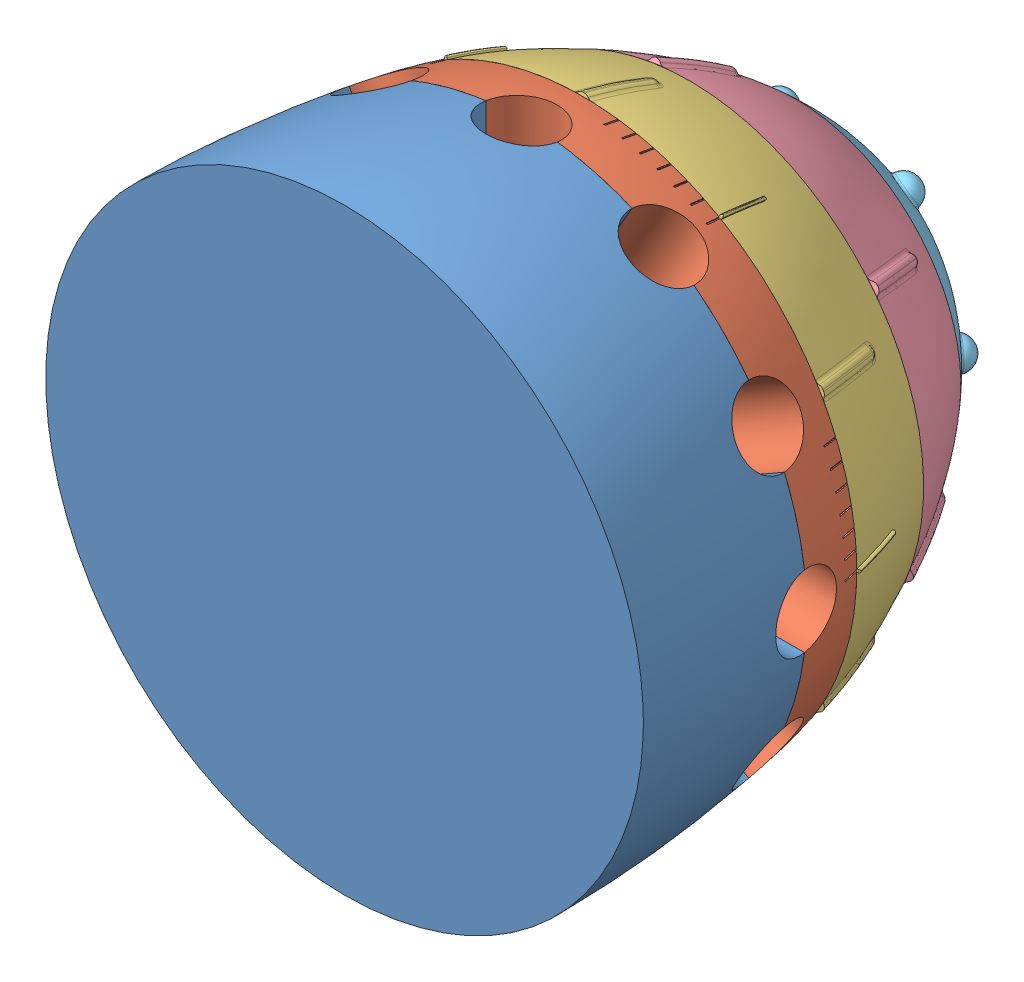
SolidWorks assembly ECOSTEM-3D BLADE-1.1.SLDASM, configuration ADJUSTABLE (file format 5000). Lengths in mm.
Overall size (63.1 63.08 44.45).
5 component instances, 5 part files, 13 mates.
Components (placement in the parent):
- ECOSTEM-3D BLADE-1.1.1-1: ECOSTEM-3D BLADE-1.1.1.sldprt [Default] at origin size (49.91 49.91 14.96)
- ECOSTEM-3D BLADE-1.1.2-1: ECOSTEM-3D BLADE-1.1.2.sldprt [Default] x (-1 0 0) z (0 0 1) size (47.62 47.62 5.3)
- ECOSTEM-3D BLADE-1.1.3-1: ECOSTEM-3D BLADE-1.1.3.sldprt [Default] x (0.866025 -0.5 0) z (0 0 1) size (46.21 46.16 8.92)
- ECOSTEM-3D BLADE-1.1.4-1: ECOSTEM-3D BLADE-1.1.4.sldprt [Default] x (0.939693 -0.34202 0) z (0 0 1) size (39.86 39.12 8.92)
- ECOSTEM-3D BLADE-1.1.5-1: ECOSTEM-3D BLADE-1.1.5.sldprt [Default] x (0.996195 -0.087156 0) z (0 0 1) size (27.56 27.56 6.76)
Mates (geometry in assembly coordinates):
- Coincident1: coincident aligned: axis of ECOSTEM-3D BLADE-1.1.1-1 through (0 0 -14.4232) axis (0 0 1); axis of ECOSTEM-3D BLADE-1.1.2-1 through (0 0 -13.5094) axis (0 0 1)
- Coincident2: coincident anti-aligned: plane of ECOSTEM-3D BLADE-1.1.1-1 through (-31.496 33.4069 -14.7828) normal (0 0 -1); plane of ECOSTEM-3D BLADE-1.1.2-1 through (31.496 -33.4069 -14.7828) normal (0 0 1)
- Coincident3: coincident anti-aligned: plane of ECOSTEM-3D BLADE-1.1.2-1 through (31.496 -28.7182 -19.9136) normal (0 0 -1); plane of ECOSTEM-3D BLADE-1.1.3-1 through (-12.9172 40.6187 -19.9136) normal (0 0 1)
- Coincident4: coincident aligned: axis of ECOSTEM-3D BLADE-1.1.1-1 through (0 0 -14.4232) axis (0 0 1); axis of ECOSTEM-3D BLADE-1.1.3-1 through (0 0 -13.0532) axis (0 0 1)
- Coincident5: coincident aligned: axis of ECOSTEM-3D BLADE-1.1.3-1 through (0 0 -13.0532) axis (0 0 1); axis of ECOSTEM-3D BLADE-1.1.4-1 through (0 0 -11.2056) axis (0 0 1)
- Coincident6: coincident anti-aligned: plane of ECOSTEM-3D BLADE-1.1.3-1 through (-13.193 40.141 -28.8036) normal (0 0 -1); plane of ECOSTEM-3D BLADE-1.1.4-1 through (-19.963 37.2402 -28.8036) normal (0 0 1)
- Coincident7: coincident anti-aligned: plane of ECOSTEM-3D BLADE-1.1.5-1 through (-33.1057 -17.0235 -37.6936) normal (0 0 1); plane of ECOSTEM-3D BLADE-1.1.4-1 through (-36.3836 -7.875 -37.6936) normal (0 0 -1)
- Coincident8: coincident aligned: axis of ECOSTEM-3D BLADE-1.1.5-1 through (0 0 -7.9111) axis (0 0 1); axis of ECOSTEM-3D BLADE-1.1.4-1 through (0 0 -11.2056) axis (0 0 1)
- Coincident9: coincident anti-aligned: plane of assembly through (0 0 0) normal (1 0 0); plane of ECOSTEM-3D BLADE-1.1.2-1
- Angle2: planar angle = 0.523599 rad: plane of ECOSTEM-3D BLADE-1.1.3-1; plane of assembly through (0 0 0) normal (1 0 0)
- LimitAngle1: limit planar angle = 0.523599 rad aligned: plane of ECOSTEM-3D BLADE-1.1.3-1; plane of assembly through (0 0 0) normal (0 1 0)
- Angle4: planar angle = 0.349066 rad aligned: plane of ECOSTEM-3D BLADE-1.1.4-1; plane of assembly through (0 0 0) normal (0 1 0)
- Angle5: planar angle = 0.087266 rad aligned: plane of ECOSTEM-3D BLADE-1.1.5-1; plane of assembly through (0 0 0) normal (0 1 0)
